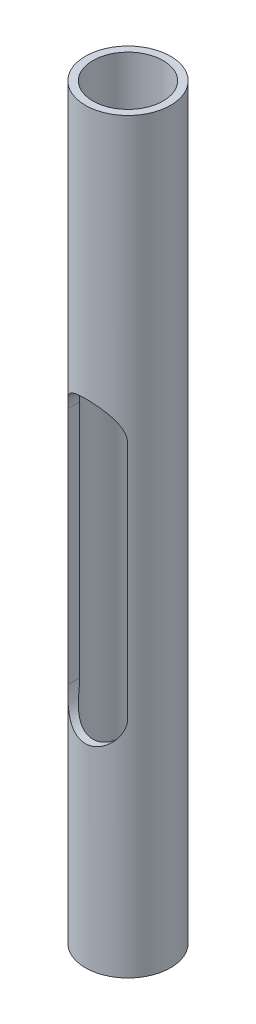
from build123d import *

# Parameters (mm, degrees)
ESQUISSE1_R                = 57
FORME_EXT_RIEURE_DEPTH     = 1000
TROU_T                     = -10
VIDEMENT_TRAPPE_REACH      = 1005.244
VIDEMENT_TRAPPE_END_RADIUS = 57


with BuildPart() as part:
    # Esquisse1 → Forme ext_rieure (new body)
    with BuildSketch(Plane(origin=(0, 0, 0), x_dir=(1, 0, 0), z_dir=(0, 1, 0))):
        with Locations(Location((0, 0, 0), (0, 0, 270))):
            Circle(ESQUISSE1_R)
    extrude(amount=FORME_EXT_RIEURE_DEPTH)

    # Trou
    trou_openings = [part.faces().sort_by_distance(p)[0] for p in [
        (0, 1000, 0),
        (0, 0, 0),
    ]]
    offset(amount=TROU_T, openings=trou_openings, kind=Kind.INTERSECTION)

    # videment trappe: up to this cylinder (the profile starts inside it)
    videment_trappe_end = Plane(origin=(0, 460, 0), z_dir=(0, -1, 0)) * Cylinder(VIDEMENT_TRAPPE_END_RADIUS, 2125.488, mode=Mode.PRIVATE)
    # Esquisse2 → videment trappe (cut, up to the surface)
    with BuildSketch(Plane.XY, mode=Mode.PRIVATE) as videment_trappe_sk1:
        with BuildLine():
            Line((40, 620), (40, 300))
            ThreePointArc((40, 300), (0, 260), (-40, 300))
            Line((-40, 300), (-40, 620))
            ThreePointArc((-40, 620), (0, 660), (40, 620))
        make_face()
    videment_trappe_tool1 = extrude(videment_trappe_sk1.sketch, amount=VIDEMENT_TRAPPE_REACH, mode=Mode.PRIVATE) & videment_trappe_end
    add(videment_trappe_tool1.solids().sort_by_distance((0, 460, 0))[0], mode=Mode.SUBTRACT)


solid = part.part
